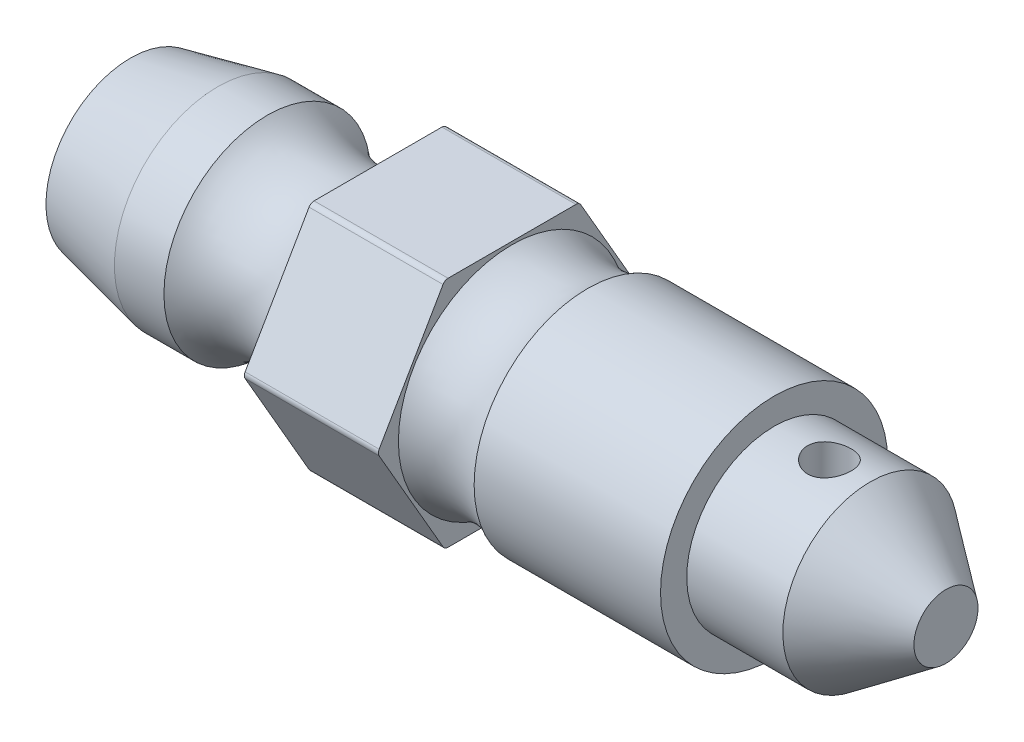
from build123d import *

# Parameters (mm, degrees)
HOLE_WIZARD_3_0_3_1_D     = 3
HOLE_WIZARD_3_0_3_1_DEPTH = 26.5
HOLE_WIZARD_3_0_3_1_TIP   = 0.901290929
HOLE_WIZARD_1_5_1_5_1_D   = 1.5
SKETCH_8_OUTSIDE_W        = 21.7
SKETCH_8_OUTSIDE_H        = 21.7
CUT_EXTRUDE_1_DEPTH       = 22.558061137
FILLET_1_R                = 0.2


with BuildPart() as part:
    # Sketch 1 → Revolve 1 (revolve)
    with BuildSketch(Plane.XY):
        Polygon((0, 0), (0, 2.9), (3, 3.55), (8.5, 3.55), (8.5, 6.5), (13.1, 6.5), (13.1, 3.9), (22.1, 3.9), (22.1, 3), (25.4, 3), (28, 1.1), (28, 0), align=None)
    revolve(axis=Axis((28, 0, 0), (-1, 0, 0)))

    # Sketch 2 → Cut-Revolve 1 (revolve, cut)
    with BuildSketch(Plane(origin=(0, 0, 0), x_dir=(1, 0, 0), z_dir=(0, 1, 0)), mode=Mode.PRIVATE) as cut_revolve_1_sk:
        with BuildLine():
            Line((4.7, 3.55), (4.7, 6.5))
            Line((4.7, 6.5), (8.5, 6.5))
            Line((8.5, 6.5), (8.5, 3.55))
            ThreePointArc((8.5, 3.55), (6.6, 2.8), (4.7, 3.55))
        make_face()
        with BuildLine():
            Line((13.1, 3.9), (13.1, 6.5))
            Line((13.1, 6.5), (15.7, 6.5))
            Line((15.7, 6.5), (15.7, 3.9))
            ThreePointArc((15.7, 3.9), (14.4, 3.55), (13.1, 3.9))
        make_face()
    revolve(cut_revolve_1_sk.sketch.rotate(Axis((0, 0, 0), (1, 0, 0)), 180), axis=Axis((0, 0, 0), (1, 0, 0)), mode=Mode.SUBTRACT)

    # Hole Wizard 3.0 _3_ _1
    with Locations(Plane.ZY):
        with Locations((0, 0)):
            Hole(HOLE_WIZARD_3_0_3_1_D / 2, depth=HOLE_WIZARD_3_0_3_1_DEPTH)
            with Locations((0, 0, -(HOLE_WIZARD_3_0_3_1_DEPTH + HOLE_WIZARD_3_0_3_1_TIP / 2))):  # 118° drill point
                Cone(0, HOLE_WIZARD_3_0_3_1_D / 2, HOLE_WIZARD_3_0_3_1_TIP, mode=Mode.SUBTRACT)

    # Hole Wizard 1.5 _1.5_ _1 (through all)
    with Locations(Plane(origin=(24, 3, 0), x_dir=(0, 0, 1), z_dir=(0, 1, 0))):
        with Locations((0, 0)):
            Hole(HOLE_WIZARD_1_5_1_5_1_D / 2)

    # Sketch 8 outside → Cut-Extrude 1 (cut, through all)
    with BuildSketch(Plane.ZY.offset(-8.5)):
        Rectangle(SKETCH_8_OUTSIDE_W, SKETCH_8_OUTSIDE_H)
        Polygon((4.618802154, 0), (2.309401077, 4), (-2.309401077, 4), (-4.618802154, 0), (-2.309401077, -4), (2.309401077, -4), align=None, mode=Mode.SUBTRACT)
    extrude(amount=-CUT_EXTRUDE_1_DEPTH, mode=Mode.SUBTRACT)

    # Fillet 1
    fillet_1_edges = [part.edges().sort_by_distance(p)[0] for p in [
        (10.8, -4, 2.309401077),
        (10.8, -4, -2.309401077),
        (10.8, 0, -4.618802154),
        (10.8, 4, -2.309401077),
        (10.8, 4, 2.309401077),
        (10.8, 0, 4.618802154),
    ]]
    fillet(fillet_1_edges, radius=FILLET_1_R)


solid = part.part
